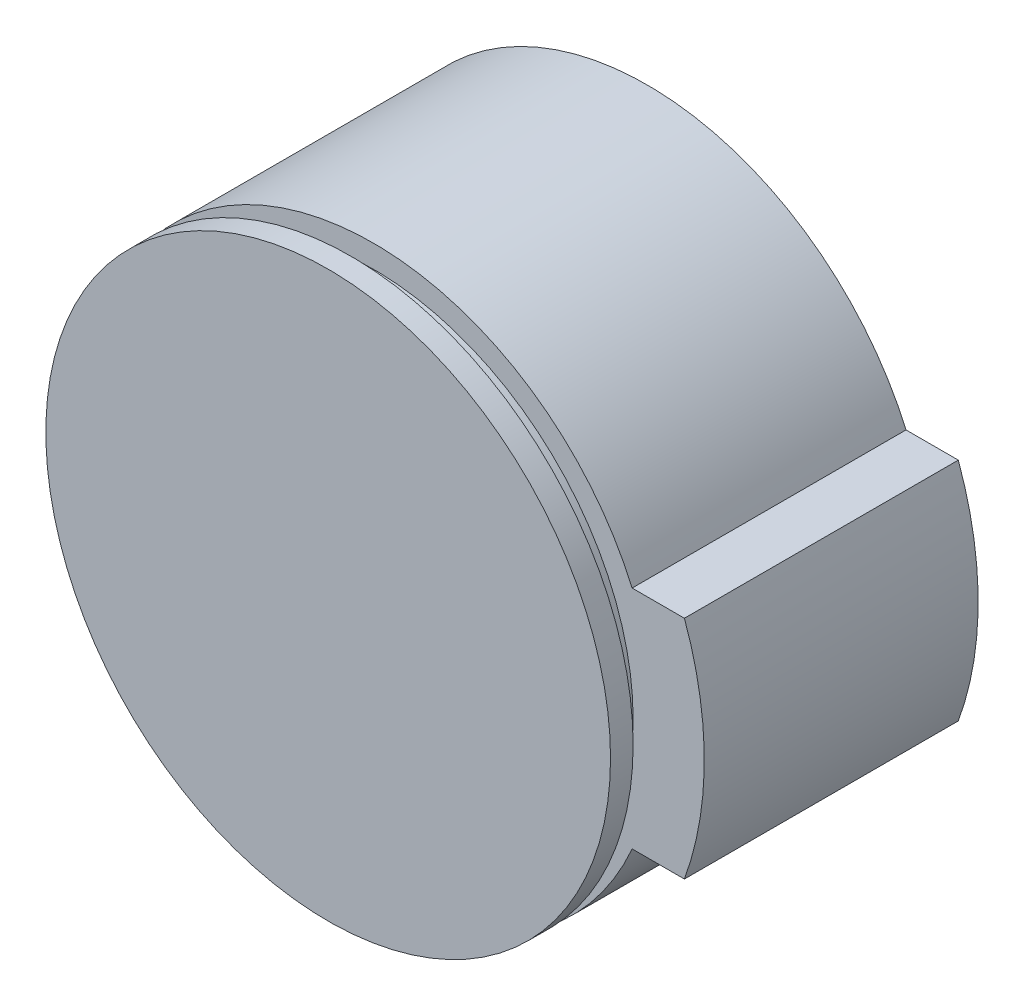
ISO-10303-21;
HEADER;
FILE_DESCRIPTION(('STEP AP214'),'2;1');
FILE_NAME('part.step','',(''),(''),'','','');
FILE_SCHEMA(('AUTOMOTIVE_DESIGN { 1 0 10303 214 1 1 1 1 }'));
ENDSEC;
DATA;
#1=APPLICATION_CONTEXT('core data for automotive mechanical design processes');
#2=APPLICATION_PROTOCOL_DEFINITION('international standard','automotive_design',2000,#1);
#3=PRODUCT_CONTEXT('',#1,'mechanical');
#4=PRODUCT('Part','Part','',(#3));
#5=PRODUCT_RELATED_PRODUCT_CATEGORY('part','',(#4));
#6=PRODUCT_DEFINITION_FORMATION('','',#4);
#7=PRODUCT_DEFINITION_CONTEXT('part definition',#1,'design');
#8=PRODUCT_DEFINITION('design','',#6,#7);
#9=PRODUCT_DEFINITION_SHAPE('','',#8);
#10=(LENGTH_UNIT() NAMED_UNIT(*) SI_UNIT(.MILLI.,.METRE.));
#11=(NAMED_UNIT(*) PLANE_ANGLE_UNIT() SI_UNIT($,.RADIAN.));
#12=(NAMED_UNIT(*) SI_UNIT($,.STERADIAN.) SOLID_ANGLE_UNIT());
#13=UNCERTAINTY_MEASURE_WITH_UNIT(LENGTH_MEASURE(1.E-05),#10,'distance_accuracy_value','');
#14=(GEOMETRIC_REPRESENTATION_CONTEXT(3) GLOBAL_UNCERTAINTY_ASSIGNED_CONTEXT((#13)) GLOBAL_UNIT_ASSIGNED_CONTEXT((#10,
#11,#12)) REPRESENTATION_CONTEXT('',''));
#15=CARTESIAN_POINT('',(0.,0.,0.));
#16=DIRECTION('',(0.,0.,1.));
#17=DIRECTION('',(1.,0.,0.));
#18=AXIS2_PLACEMENT_3D('',#15,#16,#17);
#19=CARTESIAN_POINT('',(0.,0.,0.));
#20=DIRECTION('',(0.,0.,1.));
#21=DIRECTION('',(1.,0.,0.));
#22=AXIS2_PLACEMENT_3D('',#19,#20,#21);
#23=PLANE('',#22);
#24=CARTESIAN_POINT('',(0.,0.,0.));
#25=DIRECTION('',(0.,0.,1.));
#26=DIRECTION('',(1.,0.,0.));
#27=AXIS2_PLACEMENT_3D('',#24,#25,#26);
#28=CIRCLE('',#27,25.);
#29=CARTESIAN_POINT('',(22.9128784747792,10.,0.));
#30=VERTEX_POINT('',#29);
#31=CARTESIAN_POINT('',(22.9128784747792,-10.,0.));
#32=VERTEX_POINT('',#31);
#33=EDGE_CURVE('E11',#30,#32,#28,.T.);
#34=ORIENTED_EDGE('',*,*,#33,.F.);
#35=DIRECTION('',(1.,0.,0.));
#36=VECTOR('',#35,1.);
#37=CARTESIAN_POINT('',(22.9128784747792,10.,0.));
#38=LINE('',#37,#36);
#39=CARTESIAN_POINT('',(27.5406971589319,9.99999999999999,0.));
#40=VERTEX_POINT('',#39);
#41=EDGE_CURVE('E67',#30,#40,#38,.T.);
#42=ORIENTED_EDGE('',*,*,#41,.T.);
#43=CARTESIAN_POINT('',(0.,0.,0.));
#44=DIRECTION('',(0.,0.,1.));
#45=DIRECTION('',(1.,0.,0.));
#46=AXIS2_PLACEMENT_3D('',#43,#44,#45);
#47=CIRCLE('',#46,29.3);
#48=CARTESIAN_POINT('',(27.5406971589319,-10.,0.));
#49=VERTEX_POINT('',#48);
#50=EDGE_CURVE('E71',#40,#49,#47,.F.);
#51=ORIENTED_EDGE('',*,*,#50,.T.);
#52=DIRECTION('',(-1.,0.,0.));
#53=VECTOR('',#52,1.);
#54=CARTESIAN_POINT('',(22.9128784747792,-10.,0.));
#55=LINE('',#54,#53);
#56=EDGE_CURVE('E56',#49,#32,#55,.T.);
#57=ORIENTED_EDGE('',*,*,#56,.T.);
#58=EDGE_LOOP('',(#34,#42,#51,#57));
#59=FACE_BOUND('',#58,.T.);
#60=ADVANCED_FACE('F33',(#59),#23,.F.);
#61=CARTESIAN_POINT('',(0.,0.,28.25));
#62=DIRECTION('',(0.,0.,1.));
#63=DIRECTION('',(1.,0.,0.));
#64=AXIS2_PLACEMENT_3D('',#61,#62,#63);
#65=CYLINDRICAL_SURFACE('',#64,25.);
#66=CARTESIAN_POINT('',(0.,0.,24.25));
#67=DIRECTION('',(0.,0.,1.));
#68=DIRECTION('',(1.,0.,0.));
#69=AXIS2_PLACEMENT_3D('',#66,#67,#68);
#70=CIRCLE('',#69,25.);
#71=CARTESIAN_POINT('',(22.9128784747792,10.,24.25));
#72=VERTEX_POINT('',#71);
#73=CARTESIAN_POINT('',(22.9128784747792,-10.,24.25));
#74=VERTEX_POINT('',#73);
#75=EDGE_CURVE('E40',#72,#74,#70,.T.);
#76=ORIENTED_EDGE('',*,*,#75,.F.);
#77=DIRECTION('',(0.,0.,1.));
#78=VECTOR('',#77,1.);
#79=CARTESIAN_POINT('',(22.9128784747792,10.,-20.9951261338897));
#80=LINE('',#79,#78);
#81=EDGE_CURVE('E113',#30,#72,#80,.T.);
#82=ORIENTED_EDGE('',*,*,#81,.F.);
#83=ORIENTED_EDGE('',*,*,#33,.T.);
#84=DIRECTION('',(0.,0.,1.));
#85=VECTOR('',#84,1.);
#86=CARTESIAN_POINT('',(22.9128784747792,-10.,-20.9951261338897));
#87=LINE('',#86,#85);
#88=EDGE_CURVE('E88',#32,#74,#87,.T.);
#89=ORIENTED_EDGE('',*,*,#88,.T.);
#90=EDGE_LOOP('',(#76,#82,#83,#89));
#91=FACE_BOUND('',#90,.T.);
#92=ADVANCED_FACE('F94',(#91),#65,.T.);
#93=CARTESIAN_POINT('',(0.,25.,24.25));
#94=DIRECTION('',(0.,0.,-1.));
#95=DIRECTION('',(-1.,0.,0.));
#96=AXIS2_PLACEMENT_3D('',#93,#94,#95);
#97=PLANE('',#96);
#98=CARTESIAN_POINT('',(0.,0.,24.25));
#99=DIRECTION('',(0.,0.,1.));
#100=DIRECTION('',(1.,0.,0.));
#101=AXIS2_PLACEMENT_3D('',#98,#99,#100);
#102=CIRCLE('',#101,23.);
#103=CARTESIAN_POINT('',(23.,0.,24.25));
#104=VERTEX_POINT('',#103);
#105=EDGE_CURVE('E97',#104,#104,#102,.T.);
#106=ORIENTED_EDGE('',*,*,#105,.F.);
#107=EDGE_LOOP('',(#106));
#108=FACE_BOUND('',#107,.T.);
#109=ORIENTED_EDGE('',*,*,#75,.T.);
#110=DIRECTION('',(1.,0.,0.));
#111=VECTOR('',#110,1.);
#112=CARTESIAN_POINT('',(22.9128784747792,-10.,24.25));
#113=LINE('',#112,#111);
#114=CARTESIAN_POINT('',(27.5406971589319,-10.,24.25));
#115=VERTEX_POINT('',#114);
#116=EDGE_CURVE('E85',#74,#115,#113,.T.);
#117=ORIENTED_EDGE('',*,*,#116,.T.);
#118=CARTESIAN_POINT('',(0.,0.,24.25));
#119=DIRECTION('',(0.,0.,1.));
#120=DIRECTION('',(1.,0.,0.));
#121=AXIS2_PLACEMENT_3D('',#118,#119,#120);
#122=CIRCLE('',#121,29.3);
#123=CARTESIAN_POINT('',(27.5406971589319,9.99999999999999,24.25));
#124=VERTEX_POINT('',#123);
#125=EDGE_CURVE('E90',#115,#124,#122,.T.);
#126=ORIENTED_EDGE('',*,*,#125,.T.);
#127=DIRECTION('',(-1.,0.,0.));
#128=VECTOR('',#127,1.);
#129=CARTESIAN_POINT('',(22.9128784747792,10.,24.25));
#130=LINE('',#129,#128);
#131=EDGE_CURVE('E47',#124,#72,#130,.T.);
#132=ORIENTED_EDGE('',*,*,#131,.T.);
#133=EDGE_LOOP('',(#109,#117,#126,#132));
#134=FACE_BOUND('',#133,.T.);
#135=ADVANCED_FACE('F96',(#108,#134),#97,.F.);
#136=CARTESIAN_POINT('',(0.,0.,28.25));
#137=DIRECTION('',(0.,0.,1.));
#138=DIRECTION('',(1.,0.,0.));
#139=AXIS2_PLACEMENT_3D('',#136,#137,#138);
#140=CYLINDRICAL_SURFACE('',#139,23.);
#141=CARTESIAN_POINT('',(0.,0.,26.25));
#142=DIRECTION('',(0.,0.,1.));
#143=DIRECTION('',(1.,0.,0.));
#144=AXIS2_PLACEMENT_3D('',#141,#142,#143);
#145=CIRCLE('',#144,23.);
#146=CARTESIAN_POINT('',(23.,0.,26.25));
#147=VERTEX_POINT('',#146);
#148=EDGE_CURVE('E99',#147,#147,#145,.T.);
#149=ORIENTED_EDGE('',*,*,#148,.F.);
#150=EDGE_LOOP('',(#149));
#151=FACE_BOUND('',#150,.T.);
#152=ORIENTED_EDGE('',*,*,#105,.T.);
#153=EDGE_LOOP('',(#152));
#154=FACE_BOUND('',#153,.T.);
#155=ADVANCED_FACE('F138',(#151,#154),#140,.T.);
#156=CARTESIAN_POINT('',(0.,23.,26.25));
#157=DIRECTION('',(0.,0.,1.));
#158=DIRECTION('',(1.,0.,0.));
#159=AXIS2_PLACEMENT_3D('',#156,#157,#158);
#160=PLANE('',#159);
#161=CARTESIAN_POINT('',(0.,0.,26.25));
#162=DIRECTION('',(0.,0.,1.));
#163=DIRECTION('',(1.,0.,0.));
#164=AXIS2_PLACEMENT_3D('',#161,#162,#163);
#165=CIRCLE('',#164,25.);
#166=CARTESIAN_POINT('',(25.,0.,26.25));
#167=VERTEX_POINT('',#166);
#168=EDGE_CURVE('E104',#167,#167,#165,.T.);
#169=ORIENTED_EDGE('',*,*,#168,.F.);
#170=EDGE_LOOP('',(#169));
#171=FACE_BOUND('',#170,.T.);
#172=ORIENTED_EDGE('',*,*,#148,.T.);
#173=EDGE_LOOP('',(#172));
#174=FACE_BOUND('',#173,.T.);
#175=ADVANCED_FACE('F144',(#171,#174),#160,.F.);
#176=CARTESIAN_POINT('',(0.,0.,28.25));
#177=DIRECTION('',(0.,0.,1.));
#178=DIRECTION('',(1.,0.,0.));
#179=AXIS2_PLACEMENT_3D('',#176,#177,#178);
#180=CYLINDRICAL_SURFACE('',#179,25.);
#181=CARTESIAN_POINT('',(0.,0.,28.25));
#182=DIRECTION('',(0.,0.,1.));
#183=DIRECTION('',(1.,0.,0.));
#184=AXIS2_PLACEMENT_3D('',#181,#182,#183);
#185=CIRCLE('',#184,25.);
#186=CARTESIAN_POINT('',(25.,0.,28.25));
#187=VERTEX_POINT('',#186);
#188=EDGE_CURVE('E107',#187,#187,#185,.T.);
#189=ORIENTED_EDGE('',*,*,#188,.F.);
#190=EDGE_LOOP('',(#189));
#191=FACE_BOUND('',#190,.T.);
#192=ORIENTED_EDGE('',*,*,#168,.T.);
#193=EDGE_LOOP('',(#192));
#194=FACE_BOUND('',#193,.T.);
#195=ADVANCED_FACE('F128',(#191,#194),#180,.T.);
#196=CARTESIAN_POINT('',(0.,25.,28.25));
#197=DIRECTION('',(0.,0.,-1.));
#198=DIRECTION('',(-1.,0.,0.));
#199=AXIS2_PLACEMENT_3D('',#196,#197,#198);
#200=PLANE('',#199);
#201=ORIENTED_EDGE('',*,*,#188,.T.);
#202=EDGE_LOOP('',(#201));
#203=FACE_BOUND('',#202,.T.);
#204=ADVANCED_FACE('F121',(#203),#200,.F.);
#205=CARTESIAN_POINT('',(22.9128784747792,10.,-20.9951261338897));
#206=DIRECTION('',(0.,1.,0.));
#207=DIRECTION('',(0.,0.,1.));
#208=AXIS2_PLACEMENT_3D('',#205,#206,#207);
#209=PLANE('',#208);
#210=ORIENTED_EDGE('',*,*,#41,.F.);
#211=ORIENTED_EDGE('',*,*,#81,.T.);
#212=ORIENTED_EDGE('',*,*,#131,.F.);
#213=DIRECTION('',(0.,0.,1.));
#214=VECTOR('',#213,1.);
#215=CARTESIAN_POINT('',(27.5406971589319,9.99999999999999,-20.9951261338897));
#216=LINE('',#215,#214);
#217=EDGE_CURVE('E77',#40,#124,#216,.T.);
#218=ORIENTED_EDGE('',*,*,#217,.F.);
#219=EDGE_LOOP('',(#210,#211,#212,#218));
#220=FACE_BOUND('',#219,.T.);
#221=ADVANCED_FACE('F119',(#220),#209,.T.);
#222=CARTESIAN_POINT('',(0.,0.,-20.9951261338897));
#223=DIRECTION('',(0.,0.,1.));
#224=DIRECTION('',(1.,0.,0.));
#225=AXIS2_PLACEMENT_3D('',#222,#223,#224);
#226=CYLINDRICAL_SURFACE('',#225,29.3);
#227=ORIENTED_EDGE('',*,*,#50,.F.);
#228=ORIENTED_EDGE('',*,*,#217,.T.);
#229=ORIENTED_EDGE('',*,*,#125,.F.);
#230=DIRECTION('',(0.,0.,1.));
#231=VECTOR('',#230,1.);
#232=CARTESIAN_POINT('',(27.5406971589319,-10.,-20.9951261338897));
#233=LINE('',#232,#231);
#234=EDGE_CURVE('E89',#49,#115,#233,.T.);
#235=ORIENTED_EDGE('',*,*,#234,.F.);
#236=EDGE_LOOP('',(#227,#228,#229,#235));
#237=FACE_BOUND('',#236,.T.);
#238=ADVANCED_FACE('F118',(#237),#226,.T.);
#239=CARTESIAN_POINT('',(22.9128784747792,-10.,-20.9951261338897));
#240=DIRECTION('',(0.,-1.,0.));
#241=DIRECTION('',(0.,0.,-1.));
#242=AXIS2_PLACEMENT_3D('',#239,#240,#241);
#243=PLANE('',#242);
#244=ORIENTED_EDGE('',*,*,#56,.F.);
#245=ORIENTED_EDGE('',*,*,#234,.T.);
#246=ORIENTED_EDGE('',*,*,#116,.F.);
#247=ORIENTED_EDGE('',*,*,#88,.F.);
#248=EDGE_LOOP('',(#244,#245,#246,#247));
#249=FACE_BOUND('',#248,.T.);
#250=ADVANCED_FACE('F87',(#249),#243,.T.);
#251=CLOSED_SHELL('',(#60,#92,#135,#155,#175,#195,#204,#221,#238,#250));
#252=MANIFOLD_SOLID_BREP('B2',#251);
#253=ADVANCED_BREP_SHAPE_REPRESENTATION('',(#18,#252),#14);
#254=SHAPE_DEFINITION_REPRESENTATION(#9,#253);
ENDSEC;
END-ISO-10303-21;
